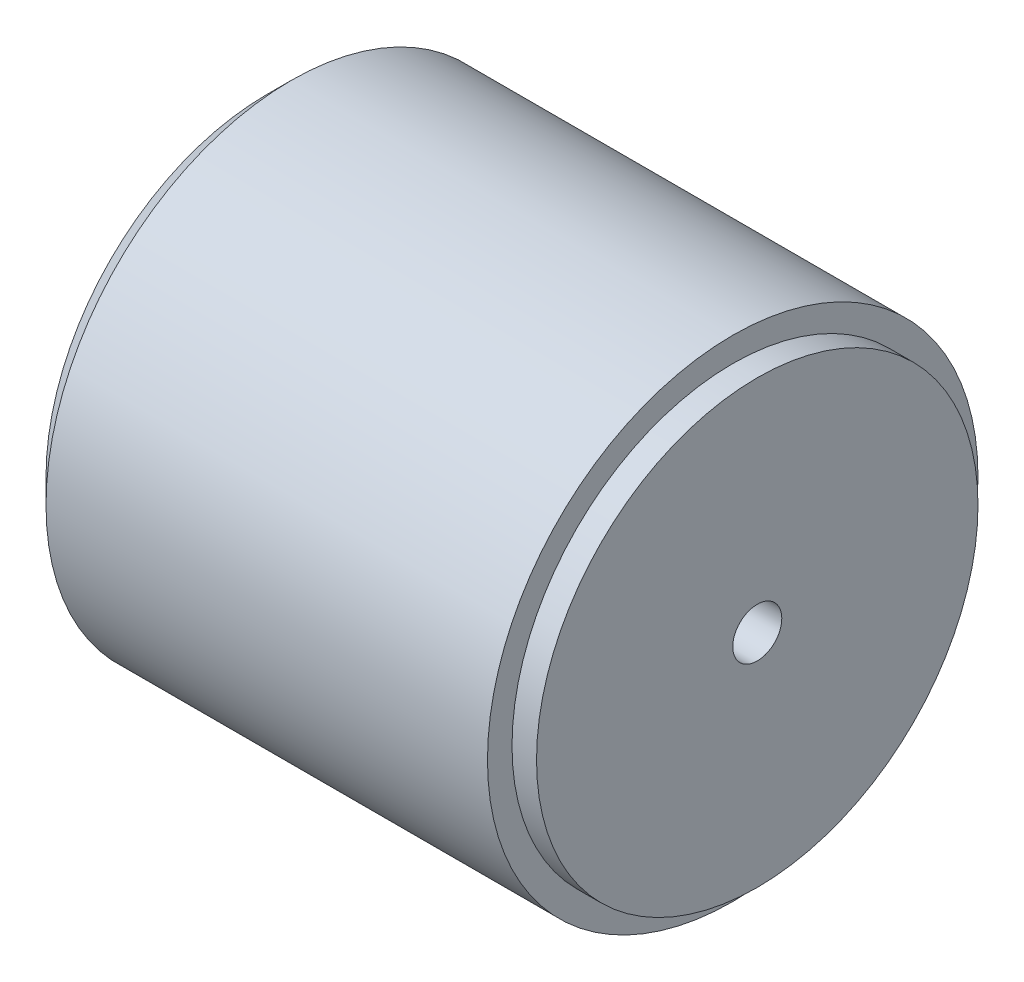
ISO-10303-21;
HEADER;
FILE_DESCRIPTION(('STEP AP214'),'2;1');
FILE_NAME('part.step','',(''),(''),'','','');
FILE_SCHEMA(('AUTOMOTIVE_DESIGN { 1 0 10303 214 1 1 1 1 }'));
ENDSEC;
DATA;
#1=APPLICATION_CONTEXT('core data for automotive mechanical design processes');
#2=APPLICATION_PROTOCOL_DEFINITION('international standard','automotive_design',2000,#1);
#3=PRODUCT_CONTEXT('',#1,'mechanical');
#4=PRODUCT('Part','Part','',(#3));
#5=PRODUCT_RELATED_PRODUCT_CATEGORY('part','',(#4));
#6=PRODUCT_DEFINITION_FORMATION('','',#4);
#7=PRODUCT_DEFINITION_CONTEXT('part definition',#1,'design');
#8=PRODUCT_DEFINITION('design','',#6,#7);
#9=PRODUCT_DEFINITION_SHAPE('','',#8);
#10=(LENGTH_UNIT() NAMED_UNIT(*) SI_UNIT(.MILLI.,.METRE.));
#11=(NAMED_UNIT(*) PLANE_ANGLE_UNIT() SI_UNIT($,.RADIAN.));
#12=(NAMED_UNIT(*) SI_UNIT($,.STERADIAN.) SOLID_ANGLE_UNIT());
#13=UNCERTAINTY_MEASURE_WITH_UNIT(LENGTH_MEASURE(1.E-05),#10,'distance_accuracy_value','');
#14=(GEOMETRIC_REPRESENTATION_CONTEXT(3) GLOBAL_UNCERTAINTY_ASSIGNED_CONTEXT((#13)) GLOBAL_UNIT_ASSIGNED_CONTEXT((#10,
#11,#12)) REPRESENTATION_CONTEXT('',''));
#15=CARTESIAN_POINT('',(0.,0.,0.));
#16=DIRECTION('',(0.,0.,1.));
#17=DIRECTION('',(1.,0.,0.));
#18=AXIS2_PLACEMENT_3D('',#15,#16,#17);
#19=CARTESIAN_POINT('',(-20.,0.,0.));
#20=DIRECTION('',(1.,0.,0.));
#21=DIRECTION('',(0.,0.,-1.));
#22=AXIS2_PLACEMENT_3D('',#19,#20,#21);
#23=CYLINDRICAL_SURFACE('',#22,9.);
#24=CARTESIAN_POINT('',(-1.,0.,0.));
#25=DIRECTION('',(1.,0.,0.));
#26=DIRECTION('',(0.,0.,-1.));
#27=AXIS2_PLACEMENT_3D('',#24,#25,#26);
#28=CIRCLE('',#27,9.);
#29=CARTESIAN_POINT('',(-1.,0.,-9.));
#30=VERTEX_POINT('',#29);
#31=EDGE_CURVE('P0_E15',#30,#30,#28,.F.);
#32=ORIENTED_EDGE('',*,*,#31,.T.);
#33=EDGE_LOOP('',(#32));
#34=FACE_BOUND('',#33,.T.);
#35=CARTESIAN_POINT('',(-20.,0.,0.));
#36=DIRECTION('',(1.,0.,0.));
#37=DIRECTION('',(0.,0.,-1.));
#38=AXIS2_PLACEMENT_3D('',#35,#36,#37);
#39=CIRCLE('',#38,9.);
#40=CARTESIAN_POINT('',(-20.,0.,-9.));
#41=VERTEX_POINT('',#40);
#42=EDGE_CURVE('P0_E10',#41,#41,#39,.T.);
#43=ORIENTED_EDGE('',*,*,#42,.T.);
#44=EDGE_LOOP('',(#43));
#45=FACE_BOUND('',#44,.T.);
#46=ADVANCED_FACE('P0_F14',(#34,#45),#23,.T.);
#47=OPEN_SHELL('',(#46));
#48=SHELL_BASED_SURFACE_MODEL('P0_B1',(#47));
#49=CARTESIAN_POINT('',(-21.,0.,0.));
#50=DIRECTION('',(-1.,0.,0.));
#51=DIRECTION('',(0.,0.,1.));
#52=AXIS2_PLACEMENT_3D('',#49,#50,#51);
#53=PLANE('',#52);
#54=CARTESIAN_POINT('',(-21.,0.,0.));
#55=DIRECTION('',(1.,0.,0.));
#56=DIRECTION('',(0.,0.,-1.));
#57=AXIS2_PLACEMENT_3D('',#54,#55,#56);
#58=CIRCLE('',#57,1.);
#59=CARTESIAN_POINT('',(-21.,0.,-1.));
#60=VERTEX_POINT('',#59);
#61=EDGE_CURVE('P1_E44',#60,#60,#58,.T.);
#62=ORIENTED_EDGE('',*,*,#61,.T.);
#63=EDGE_LOOP('',(#62));
#64=FACE_BOUND('',#63,.T.);
#65=CARTESIAN_POINT('',(-20.9999999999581,0.,0.));
#66=DIRECTION('',(1.,0.,0.));
#67=DIRECTION('',(0.,0.,-1.));
#68=AXIS2_PLACEMENT_3D('',#65,#66,#67);
#69=CIRCLE('',#68,1.25000000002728);
#70=CARTESIAN_POINT('',(-20.9999999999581,0.,-1.25000000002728));
#71=VERTEX_POINT('',#70);
#72=EDGE_CURVE('P1_E17',#71,#71,#69,.T.);
#73=ORIENTED_EDGE('',*,*,#72,.F.);
#74=EDGE_LOOP('',(#73));
#75=FACE_BOUND('',#74,.T.);
#76=ADVANCED_FACE('P1_F14',(#64,#75),#53,.T.);
#77=CARTESIAN_POINT('',(-20.7500000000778,0.,0.));
#78=DIRECTION('',(1.,0.,0.));
#79=DIRECTION('',(0.,0.,-1.));
#80=AXIS2_PLACEMENT_3D('',#77,#78,#79);
#81=CONICAL_SURFACE('',#80,1.49999999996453,0.785398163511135);
#82=CARTESIAN_POINT('',(-20.75,0.,0.));
#83=DIRECTION('',(-1.,0.,0.));
#84=DIRECTION('',(0.,0.,1.));
#85=AXIS2_PLACEMENT_3D('',#82,#83,#84);
#86=CIRCLE('',#85,1.5);
#87=CARTESIAN_POINT('',(-20.75,0.,1.5));
#88=VERTEX_POINT('',#87);
#89=EDGE_CURVE('P1_E30',#88,#88,#86,.F.);
#90=ORIENTED_EDGE('',*,*,#89,.F.);
#91=EDGE_LOOP('',(#90));
#92=FACE_BOUND('',#91,.T.);
#93=ORIENTED_EDGE('',*,*,#72,.T.);
#94=EDGE_LOOP('',(#93));
#95=FACE_BOUND('',#94,.T.);
#96=ADVANCED_FACE('P1_F52',(#92,#95),#81,.T.);
#97=CARTESIAN_POINT('',(0.,0.,0.));
#98=DIRECTION('',(1.,0.,0.));
#99=DIRECTION('',(0.,0.,-1.));
#100=AXIS2_PLACEMENT_3D('',#97,#98,#99);
#101=CYLINDRICAL_SURFACE('',#100,1.);
#102=ORIENTED_EDGE('',*,*,#61,.F.);
#103=EDGE_LOOP('',(#102));
#104=FACE_BOUND('',#103,.T.);
#105=CARTESIAN_POINT('',(0.,0.,0.));
#106=DIRECTION('',(1.,0.,0.));
#107=DIRECTION('',(0.,0.,-1.));
#108=AXIS2_PLACEMENT_3D('',#105,#106,#107);
#109=CIRCLE('',#108,1.);
#110=CARTESIAN_POINT('',(0.,0.,-1.));
#111=VERTEX_POINT('',#110);
#112=EDGE_CURVE('P1_E42',#111,#111,#109,.T.);
#113=ORIENTED_EDGE('',*,*,#112,.T.);
#114=EDGE_LOOP('',(#113));
#115=FACE_BOUND('',#114,.T.);
#116=ADVANCED_FACE('P1_F60',(#104,#115),#101,.F.);
#117=CARTESIAN_POINT('',(-20.,0.,0.));
#118=DIRECTION('',(-1.,0.,0.));
#119=DIRECTION('',(0.,0.,1.));
#120=AXIS2_PLACEMENT_3D('',#117,#118,#119);
#121=CYLINDRICAL_SURFACE('',#120,1.5);
#122=CARTESIAN_POINT('',(-20.,0.,0.));
#123=DIRECTION('',(-1.,0.,0.));
#124=DIRECTION('',(0.,0.,1.));
#125=AXIS2_PLACEMENT_3D('',#122,#123,#124);
#126=CIRCLE('',#125,1.5);
#127=CARTESIAN_POINT('',(-20.,0.,1.5));
#128=VERTEX_POINT('',#127);
#129=EDGE_CURVE('P1_E39',#128,#128,#126,.F.);
#130=ORIENTED_EDGE('',*,*,#129,.F.);
#131=EDGE_LOOP('',(#130));
#132=FACE_BOUND('',#131,.T.);
#133=ORIENTED_EDGE('',*,*,#89,.T.);
#134=EDGE_LOOP('',(#133));
#135=FACE_BOUND('',#134,.T.);
#136=ADVANCED_FACE('P1_F89',(#132,#135),#121,.T.);
#137=CARTESIAN_POINT('',(0.,16.53154568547,-15.5));
#138=DIRECTION('',(-1.,0.,0.));
#139=DIRECTION('',(0.,0.,1.));
#140=AXIS2_PLACEMENT_3D('',#137,#138,#139);
#141=PLANE('',#140);
#142=ORIENTED_EDGE('',*,*,#112,.F.);
#143=EDGE_LOOP('',(#142));
#144=FACE_BOUND('',#143,.T.);
#145=CARTESIAN_POINT('',(0.,0.,0.));
#146=DIRECTION('',(1.,0.,0.));
#147=DIRECTION('',(0.,0.,-1.));
#148=AXIS2_PLACEMENT_3D('',#145,#146,#147);
#149=CIRCLE('',#148,9.);
#150=CARTESIAN_POINT('',(0.,0.,-9.));
#151=VERTEX_POINT('',#150);
#152=EDGE_CURVE('P1_E36',#151,#151,#149,.F.);
#153=ORIENTED_EDGE('',*,*,#152,.F.);
#154=EDGE_LOOP('',(#153));
#155=FACE_BOUND('',#154,.T.);
#156=ADVANCED_FACE('P1_F85',(#144,#155),#141,.F.);
#157=CARTESIAN_POINT('',(-20.,0.,0.));
#158=DIRECTION('',(-1.,0.,0.));
#159=DIRECTION('',(0.,0.,1.));
#160=AXIS2_PLACEMENT_3D('',#157,#158,#159);
#161=PLANE('',#160);
#162=ORIENTED_EDGE('',*,*,#129,.T.);
#163=EDGE_LOOP('',(#162));
#164=FACE_BOUND('',#163,.T.);
#165=CARTESIAN_POINT('',(-20.,0.,0.));
#166=DIRECTION('',(1.,0.,0.));
#167=DIRECTION('',(0.,0.,-1.));
#168=AXIS2_PLACEMENT_3D('',#165,#166,#167);
#169=CIRCLE('',#168,9.);
#170=CARTESIAN_POINT('',(-20.,0.,-9.));
#171=VERTEX_POINT('',#170);
#172=EDGE_CURVE('P1_E33',#171,#171,#169,.T.);
#173=ORIENTED_EDGE('',*,*,#172,.F.);
#174=EDGE_LOOP('',(#173));
#175=FACE_BOUND('',#174,.T.);
#176=ADVANCED_FACE('P1_F81',(#164,#175),#161,.T.);
#177=CARTESIAN_POINT('',(-2.1,0.,0.));
#178=DIRECTION('',(1.,0.,0.));
#179=DIRECTION('',(0.,0.,-1.));
#180=AXIS2_PLACEMENT_3D('',#177,#178,#179);
#181=CYLINDRICAL_SURFACE('',#180,9.);
#182=CARTESIAN_POINT('',(-1.,0.,0.));
#183=DIRECTION('',(1.,0.,0.));
#184=DIRECTION('',(0.,0.,-1.));
#185=AXIS2_PLACEMENT_3D('',#182,#183,#184);
#186=CIRCLE('',#185,9.);
#187=CARTESIAN_POINT('',(-1.,0.,-9.));
#188=VERTEX_POINT('',#187);
#189=EDGE_CURVE('P1_E26',#188,#188,#186,.F.);
#190=ORIENTED_EDGE('',*,*,#189,.F.);
#191=EDGE_LOOP('',(#190));
#192=FACE_BOUND('',#191,.T.);
#193=ORIENTED_EDGE('',*,*,#152,.T.);
#194=EDGE_LOOP('',(#193));
#195=FACE_BOUND('',#194,.T.);
#196=ADVANCED_FACE('P1_F77',(#192,#195),#181,.T.);
#197=CARTESIAN_POINT('',(-19.,0.,0.));
#198=DIRECTION('',(1.,0.,0.));
#199=DIRECTION('',(0.,0.,-1.));
#200=AXIS2_PLACEMENT_3D('',#197,#198,#199);
#201=CONICAL_SURFACE('',#200,10.,0.785398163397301);
#202=CARTESIAN_POINT('',(-19.,0.,0.));
#203=DIRECTION('',(-1.,0.,0.));
#204=DIRECTION('',(0.,0.,1.));
#205=AXIS2_PLACEMENT_3D('',#202,#203,#204);
#206=CIRCLE('',#205,10.);
#207=CARTESIAN_POINT('',(-19.,0.,10.));
#208=VERTEX_POINT('',#207);
#209=EDGE_CURVE('P1_E21',#208,#208,#206,.F.);
#210=ORIENTED_EDGE('',*,*,#209,.F.);
#211=EDGE_LOOP('',(#210));
#212=FACE_BOUND('',#211,.T.);
#213=ORIENTED_EDGE('',*,*,#172,.T.);
#214=EDGE_LOOP('',(#213));
#215=FACE_BOUND('',#214,.T.);
#216=ADVANCED_FACE('P1_F71',(#212,#215),#201,.T.);
#217=CARTESIAN_POINT('',(-1.,0.,0.));
#218=DIRECTION('',(1.,0.,0.));
#219=DIRECTION('',(0.,0.,-1.));
#220=AXIS2_PLACEMENT_3D('',#217,#218,#219);
#221=PLANE('',#220);
#222=ORIENTED_EDGE('',*,*,#189,.T.);
#223=EDGE_LOOP('',(#222));
#224=FACE_BOUND('',#223,.T.);
#225=CARTESIAN_POINT('',(-1.,0.,0.));
#226=DIRECTION('',(-1.,0.,0.));
#227=DIRECTION('',(0.,0.,1.));
#228=AXIS2_PLACEMENT_3D('',#225,#226,#227);
#229=CIRCLE('',#228,10.);
#230=CARTESIAN_POINT('',(-1.,0.,10.));
#231=VERTEX_POINT('',#230);
#232=EDGE_CURVE('P1_E10',#231,#231,#229,.T.);
#233=ORIENTED_EDGE('',*,*,#232,.F.);
#234=EDGE_LOOP('',(#233));
#235=FACE_BOUND('',#234,.T.);
#236=ADVANCED_FACE('P1_F64',(#224,#235),#221,.T.);
#237=CARTESIAN_POINT('',(0.,0.,0.));
#238=DIRECTION('',(-1.,0.,0.));
#239=DIRECTION('',(0.,0.,1.));
#240=AXIS2_PLACEMENT_3D('',#237,#238,#239);
#241=CYLINDRICAL_SURFACE('',#240,10.);
#242=ORIENTED_EDGE('',*,*,#209,.T.);
#243=EDGE_LOOP('',(#242));
#244=FACE_BOUND('',#243,.T.);
#245=ORIENTED_EDGE('',*,*,#232,.T.);
#246=EDGE_LOOP('',(#245));
#247=FACE_BOUND('',#246,.T.);
#248=ADVANCED_FACE('P1_F62',(#244,#247),#241,.T.);
#249=CLOSED_SHELL('',(#76,#96,#116,#136,#156,#176,#196,#216,#236,#248));
#250=MANIFOLD_SOLID_BREP('P1_B1',#249);
#251=ADVANCED_BREP_SHAPE_REPRESENTATION('',(#18,#250),#14);
#252=MANIFOLD_SURFACE_SHAPE_REPRESENTATION('',(#18,#48),#14);
#253=SHAPE_REPRESENTATION('',(#18),#14);
#254=SHAPE_DEFINITION_REPRESENTATION(#9,#253);
#255=SHAPE_REPRESENTATION_RELATIONSHIP('','',#253,#251);
#256=SHAPE_REPRESENTATION_RELATIONSHIP('','',#253,#252);
ENDSEC;
END-ISO-10303-21;
